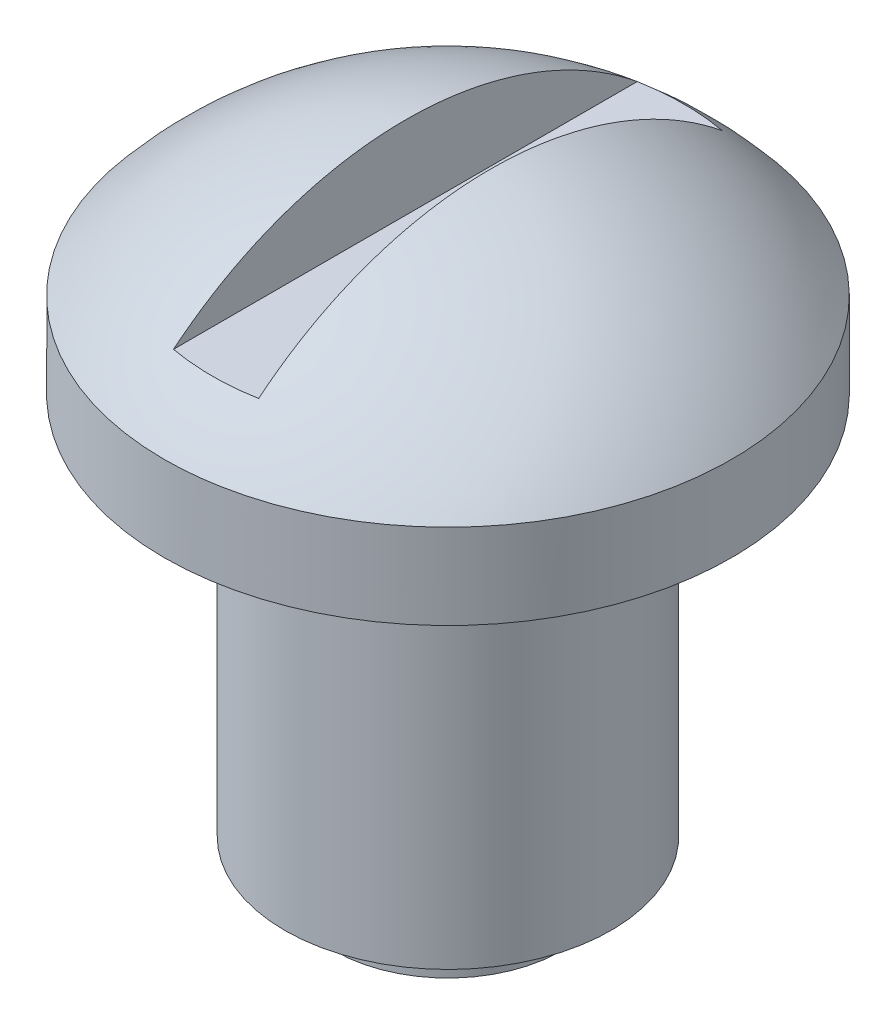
ISO-10303-21;
HEADER;
FILE_DESCRIPTION(('STEP AP214'),'2;1');
FILE_NAME('part.step','',(''),(''),'','','');
FILE_SCHEMA(('AUTOMOTIVE_DESIGN { 1 0 10303 214 1 1 1 1 }'));
ENDSEC;
DATA;
#1=APPLICATION_CONTEXT('core data for automotive mechanical design processes');
#2=APPLICATION_PROTOCOL_DEFINITION('international standard','automotive_design',2000,#1);
#3=PRODUCT_CONTEXT('',#1,'mechanical');
#4=PRODUCT('Part','Part','',(#3));
#5=PRODUCT_RELATED_PRODUCT_CATEGORY('part','',(#4));
#6=PRODUCT_DEFINITION_FORMATION('','',#4);
#7=PRODUCT_DEFINITION_CONTEXT('part definition',#1,'design');
#8=PRODUCT_DEFINITION('design','',#6,#7);
#9=PRODUCT_DEFINITION_SHAPE('','',#8);
#10=(LENGTH_UNIT() NAMED_UNIT(*) SI_UNIT(.MILLI.,.METRE.));
#11=(NAMED_UNIT(*) PLANE_ANGLE_UNIT() SI_UNIT($,.RADIAN.));
#12=(NAMED_UNIT(*) SI_UNIT($,.STERADIAN.) SOLID_ANGLE_UNIT());
#13=UNCERTAINTY_MEASURE_WITH_UNIT(LENGTH_MEASURE(1.E-05),#10,'distance_accuracy_value','');
#14=(GEOMETRIC_REPRESENTATION_CONTEXT(3) GLOBAL_UNCERTAINTY_ASSIGNED_CONTEXT((#13)) GLOBAL_UNIT_ASSIGNED_CONTEXT((#10,
#11,#12)) REPRESENTATION_CONTEXT('',''));
#15=CARTESIAN_POINT('',(0.,0.,0.));
#16=DIRECTION('',(0.,0.,1.));
#17=DIRECTION('',(1.,0.,0.));
#18=AXIS2_PLACEMENT_3D('',#15,#16,#17);
#19=CARTESIAN_POINT('',(0.,-6.50000000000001,0.));
#20=DIRECTION('',(0.,1.,0.));
#21=DIRECTION('',(1.,0.,0.));
#22=AXIS2_PLACEMENT_3D('',#19,#20,#21);
#23=SPHERICAL_SURFACE('',#22,6.5);
#24=CARTESIAN_POINT('',(0.750000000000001,-6.50000000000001,0.));
#25=DIRECTION('',(1.,0.,0.));
#26=DIRECTION('',(0.,1.,0.));
#27=AXIS2_PLACEMENT_3D('',#24,#25,#26);
#28=CIRCLE('',#27,6.45658578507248);
#29=CARTESIAN_POINT('',(0.750000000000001,-1.5,-4.08503365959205));
#30=VERTEX_POINT('',#29);
#31=CARTESIAN_POINT('',(0.750000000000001,-1.5,4.08503365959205));
#32=VERTEX_POINT('',#31);
#33=EDGE_CURVE('E381',#30,#32,#28,.T.);
#34=ORIENTED_EDGE('',*,*,#33,.T.);
#35=CARTESIAN_POINT('',(0.,-1.5,0.));
#36=DIRECTION('',(0.,-1.,0.));
#37=DIRECTION('',(0.,0.,-1.));
#38=AXIS2_PLACEMENT_3D('',#35,#36,#37);
#39=CIRCLE('',#38,4.15331193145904);
#40=CARTESIAN_POINT('',(-0.750000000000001,-1.5,4.08503365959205));
#41=VERTEX_POINT('',#40);
#42=EDGE_CURVE('E11',#32,#41,#39,.T.);
#43=ORIENTED_EDGE('',*,*,#42,.T.);
#44=CARTESIAN_POINT('',(-0.750000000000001,-6.50000000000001,0.));
#45=DIRECTION('',(-1.,0.,0.));
#46=DIRECTION('',(0.,-1.,0.));
#47=AXIS2_PLACEMENT_3D('',#44,#45,#46);
#48=CIRCLE('',#47,6.45658578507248);
#49=CARTESIAN_POINT('',(-0.750000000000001,-1.5,-4.08503365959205));
#50=VERTEX_POINT('',#49);
#51=EDGE_CURVE('E351',#41,#50,#48,.T.);
#52=ORIENTED_EDGE('',*,*,#51,.T.);
#53=EDGE_CURVE('E357',#50,#30,#39,.T.);
#54=ORIENTED_EDGE('',*,*,#53,.T.);
#55=EDGE_LOOP('',(#34,#43,#52,#54));
#56=FACE_BOUND('',#55,.T.);
#57=CARTESIAN_POINT('',(0.,-2.34668806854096,0.));
#58=DIRECTION('',(0.,1.,0.));
#59=DIRECTION('',(0.,0.,1.));
#60=AXIS2_PLACEMENT_3D('',#57,#58,#59);
#61=CIRCLE('',#60,5.);
#62=CARTESIAN_POINT('',(0.,-2.34668806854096,5.));
#63=VERTEX_POINT('',#62);
#64=EDGE_CURVE('E386',#63,#63,#61,.T.);
#65=ORIENTED_EDGE('',*,*,#64,.T.);
#66=EDGE_LOOP('',(#65));
#67=FACE_BOUND('',#66,.T.);
#68=ADVANCED_FACE('F348',(#56,#67),#23,.T.);
#69=CARTESIAN_POINT('',(0.,0.,0.));
#70=DIRECTION('',(0.,1.,0.));
#71=DIRECTION('',(0.,0.,1.));
#72=AXIS2_PLACEMENT_3D('',#69,#70,#71);
#73=CYLINDRICAL_SURFACE('',#72,5.);
#74=ORIENTED_EDGE('',*,*,#64,.F.);
#75=EDGE_LOOP('',(#74));
#76=FACE_BOUND('',#75,.T.);
#77=CARTESIAN_POINT('',(0.,-3.84668806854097,0.));
#78=DIRECTION('',(0.,1.,0.));
#79=DIRECTION('',(0.,0.,1.));
#80=AXIS2_PLACEMENT_3D('',#77,#78,#79);
#81=CIRCLE('',#80,5.);
#82=CARTESIAN_POINT('',(0.,-3.84668806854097,5.));
#83=VERTEX_POINT('',#82);
#84=EDGE_CURVE('E390',#83,#83,#81,.T.);
#85=ORIENTED_EDGE('',*,*,#84,.T.);
#86=EDGE_LOOP('',(#85));
#87=FACE_BOUND('',#86,.T.);
#88=ADVANCED_FACE('F421',(#76,#87),#73,.T.);
#89=CARTESIAN_POINT('',(5.,-3.84668806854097,0.));
#90=DIRECTION('',(0.,1.,0.));
#91=DIRECTION('',(0.,0.,1.));
#92=AXIS2_PLACEMENT_3D('',#89,#90,#91);
#93=PLANE('',#92);
#94=ORIENTED_EDGE('',*,*,#84,.F.);
#95=EDGE_LOOP('',(#94));
#96=FACE_BOUND('',#95,.T.);
#97=CARTESIAN_POINT('',(0.,-3.84668806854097,0.));
#98=DIRECTION('',(0.,1.,0.));
#99=DIRECTION('',(0.,0.,1.));
#100=AXIS2_PLACEMENT_3D('',#97,#98,#99);
#101=CIRCLE('',#100,2.875);
#102=CARTESIAN_POINT('',(0.,-3.84668806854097,2.875));
#103=VERTEX_POINT('',#102);
#104=EDGE_CURVE('E393',#103,#103,#101,.T.);
#105=ORIENTED_EDGE('',*,*,#104,.T.);
#106=EDGE_LOOP('',(#105));
#107=FACE_BOUND('',#106,.T.);
#108=ADVANCED_FACE('F425',(#96,#107),#93,.F.);
#109=CARTESIAN_POINT('',(0.,0.,0.));
#110=DIRECTION('',(0.,1.,0.));
#111=DIRECTION('',(0.,0.,1.));
#112=AXIS2_PLACEMENT_3D('',#109,#110,#111);
#113=CYLINDRICAL_SURFACE('',#112,2.875);
#114=ORIENTED_EDGE('',*,*,#104,.F.);
#115=EDGE_LOOP('',(#114));
#116=FACE_BOUND('',#115,.T.);
#117=CARTESIAN_POINT('',(0.,-10.596688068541,0.));
#118=DIRECTION('',(0.,1.,0.));
#119=DIRECTION('',(0.,0.,1.));
#120=AXIS2_PLACEMENT_3D('',#117,#118,#119);
#121=CIRCLE('',#120,2.875);
#122=CARTESIAN_POINT('',(0.,-10.596688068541,2.875));
#123=VERTEX_POINT('',#122);
#124=EDGE_CURVE('E396',#123,#123,#121,.T.);
#125=ORIENTED_EDGE('',*,*,#124,.T.);
#126=EDGE_LOOP('',(#125));
#127=FACE_BOUND('',#126,.T.);
#128=ADVANCED_FACE('F430',(#116,#127),#113,.T.);
#129=CARTESIAN_POINT('',(2.87499999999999,-10.596688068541,0.));
#130=DIRECTION('',(0.,1.,0.));
#131=DIRECTION('',(0.,0.,1.));
#132=AXIS2_PLACEMENT_3D('',#129,#130,#131);
#133=PLANE('',#132);
#134=ORIENTED_EDGE('',*,*,#124,.F.);
#135=EDGE_LOOP('',(#134));
#136=FACE_BOUND('',#135,.T.);
#137=CARTESIAN_POINT('',(0.,-10.596688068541,0.));
#138=DIRECTION('',(0.,1.,0.));
#139=DIRECTION('',(0.,0.,1.));
#140=AXIS2_PLACEMENT_3D('',#137,#138,#139);
#141=CIRCLE('',#140,2.);
#142=CARTESIAN_POINT('',(0.,-10.596688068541,2.));
#143=VERTEX_POINT('',#142);
#144=EDGE_CURVE('E399',#143,#143,#141,.T.);
#145=ORIENTED_EDGE('',*,*,#144,.T.);
#146=EDGE_LOOP('',(#145));
#147=FACE_BOUND('',#146,.T.);
#148=ADVANCED_FACE('F417',(#136,#147),#133,.F.);
#149=CARTESIAN_POINT('',(0.,0.,0.));
#150=DIRECTION('',(0.,1.,0.));
#151=DIRECTION('',(0.,0.,1.));
#152=AXIS2_PLACEMENT_3D('',#149,#150,#151);
#153=CYLINDRICAL_SURFACE('',#152,2.);
#154=ORIENTED_EDGE('',*,*,#144,.F.);
#155=EDGE_LOOP('',(#154));
#156=FACE_BOUND('',#155,.T.);
#157=CARTESIAN_POINT('',(0.,-11.346688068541,0.));
#158=DIRECTION('',(0.,1.,0.));
#159=DIRECTION('',(0.,0.,1.));
#160=AXIS2_PLACEMENT_3D('',#157,#158,#159);
#161=CIRCLE('',#160,2.);
#162=CARTESIAN_POINT('',(0.,-11.346688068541,2.));
#163=VERTEX_POINT('',#162);
#164=EDGE_CURVE('E383',#163,#163,#161,.T.);
#165=ORIENTED_EDGE('',*,*,#164,.T.);
#166=EDGE_LOOP('',(#165));
#167=FACE_BOUND('',#166,.T.);
#168=ADVANCED_FACE('F406',(#156,#167),#153,.T.);
#169=CARTESIAN_POINT('',(2.,-11.346688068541,0.));
#170=DIRECTION('',(0.,1.,0.));
#171=DIRECTION('',(0.,0.,1.));
#172=AXIS2_PLACEMENT_3D('',#169,#170,#171);
#173=PLANE('',#172);
#174=ORIENTED_EDGE('',*,*,#164,.F.);
#175=EDGE_LOOP('',(#174));
#176=FACE_BOUND('',#175,.T.);
#177=ADVANCED_FACE('F408',(#176),#173,.F.);
#178=CARTESIAN_POINT('',(-0.750000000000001,0.,-5.));
#179=DIRECTION('',(-1.,0.,0.));
#180=DIRECTION('',(0.,-1.,0.));
#181=AXIS2_PLACEMENT_3D('',#178,#179,#180);
#182=PLANE('',#181);
#183=DIRECTION('',(0.,0.,1.));
#184=VECTOR('',#183,1.);
#185=CARTESIAN_POINT('',(-0.750000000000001,-1.5,-5.));
#186=LINE('',#185,#184);
#187=EDGE_CURVE('E376',#50,#41,#186,.T.);
#188=ORIENTED_EDGE('',*,*,#187,.F.);
#189=ORIENTED_EDGE('',*,*,#51,.F.);
#190=EDGE_LOOP('',(#188,#189));
#191=FACE_BOUND('',#190,.T.);
#192=ADVANCED_FACE('F410',(#191),#182,.F.);
#193=CARTESIAN_POINT('',(0.750000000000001,0.,-5.));
#194=DIRECTION('',(1.,0.,0.));
#195=DIRECTION('',(0.,1.,0.));
#196=AXIS2_PLACEMENT_3D('',#193,#194,#195);
#197=PLANE('',#196);
#198=DIRECTION('',(0.,0.,1.));
#199=VECTOR('',#198,1.);
#200=CARTESIAN_POINT('',(0.750000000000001,-1.5,-5.));
#201=LINE('',#200,#199);
#202=EDGE_CURVE('E364',#30,#32,#201,.T.);
#203=ORIENTED_EDGE('',*,*,#202,.T.);
#204=ORIENTED_EDGE('',*,*,#33,.F.);
#205=EDGE_LOOP('',(#203,#204));
#206=FACE_BOUND('',#205,.T.);
#207=ADVANCED_FACE('F380',(#206),#197,.F.);
#208=CARTESIAN_POINT('',(-0.750000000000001,-1.5,-5.));
#209=DIRECTION('',(0.,-1.,0.));
#210=DIRECTION('',(0.,0.,-1.));
#211=AXIS2_PLACEMENT_3D('',#208,#209,#210);
#212=PLANE('',#211);
#213=ORIENTED_EDGE('',*,*,#202,.F.);
#214=ORIENTED_EDGE('',*,*,#53,.F.);
#215=ORIENTED_EDGE('',*,*,#187,.T.);
#216=ORIENTED_EDGE('',*,*,#42,.F.);
#217=EDGE_LOOP('',(#213,#214,#215,#216));
#218=FACE_BOUND('',#217,.T.);
#219=ADVANCED_FACE('F375',(#218),#212,.F.);
#220=CLOSED_SHELL('',(#68,#88,#108,#128,#148,#168,#177,#192,#207,#219));
#221=MANIFOLD_SOLID_BREP('B2',#220);
#222=ADVANCED_BREP_SHAPE_REPRESENTATION('',(#18,#221),#14);
#223=SHAPE_DEFINITION_REPRESENTATION(#9,#222);
ENDSEC;
END-ISO-10303-21;
